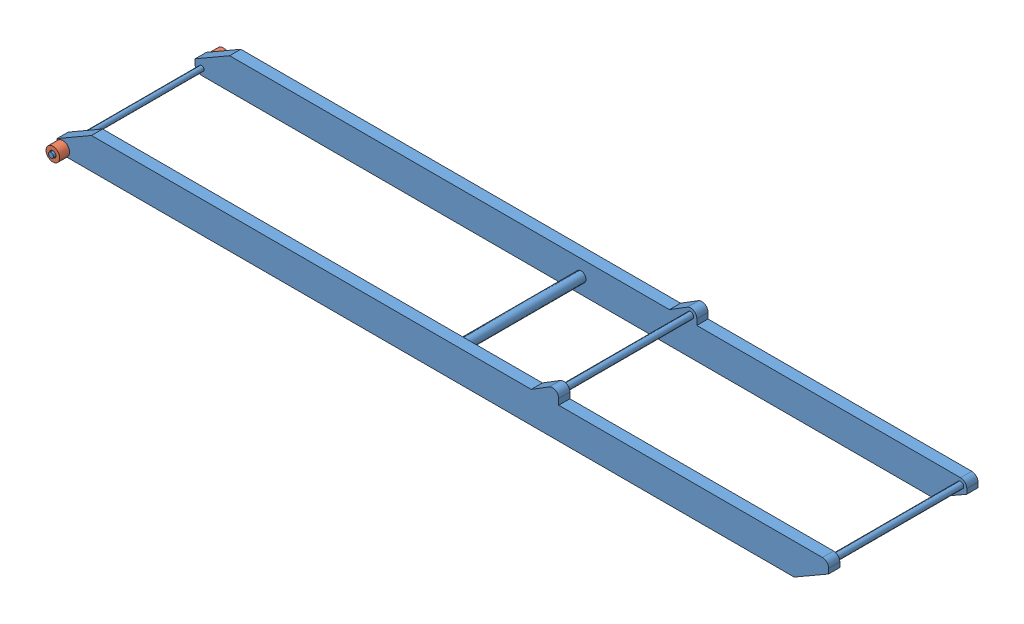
SolidWorks assembly Assemblage2.sldasm, configuration Défaut (file format 3400). Lengths in mm.
Overall size (6223.17 372.02 1400).
3 component instances, 2 part files, 4 mates.
Components (placement in the parent):
- ciseau 1-1: ciseau 1.SLDPRT [Défaut] at origin size (6200 347 1400)
- galet-1: galet.SLDPRT [Défaut] at (-6098.1555 -150 605) size (110 110 80)
- galet-2: galet.SLDPRT [Défaut] at (-6098.1555 -150 -685) x (-0.495157 -0.868804 0) z (0 0 1) size (110 110 80)
Mates (geometry in assembly coordinates):
- Coaxiale1: concentric aligned: cylinder of ?; cylinder of ?
- Distance1: distance = 5 mm anti-aligned: plane of ?; plane of ?
- Coaxiale2: concentric aligned: cylinder of ?; cylinder of ?
- Distance2: distance = 5 mm anti-aligned: plane of ?; plane of ?
